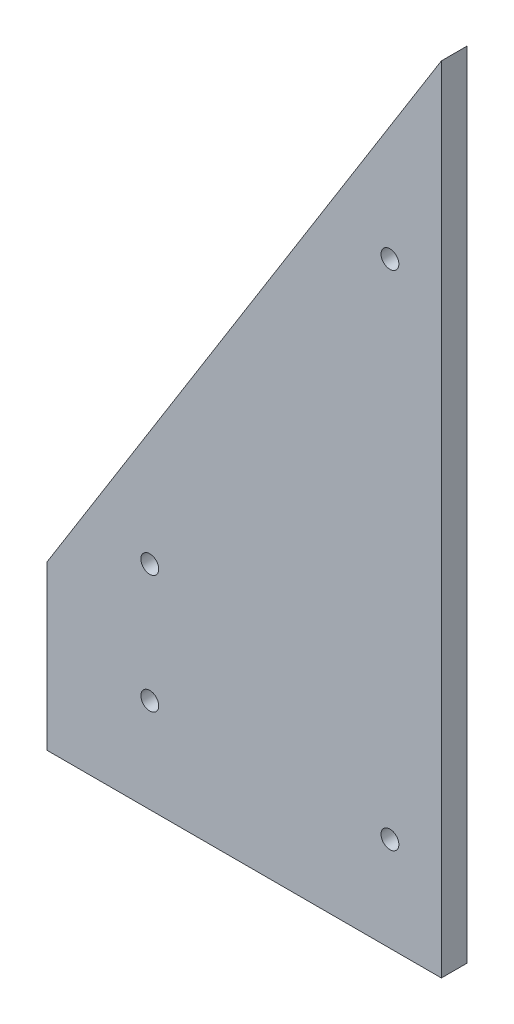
ISO-10303-21;
HEADER;
FILE_DESCRIPTION(('STEP AP214'),'2;1');
FILE_NAME('part.step','',(''),(''),'','','');
FILE_SCHEMA(('AUTOMOTIVE_DESIGN { 1 0 10303 214 1 1 1 1 }'));
ENDSEC;
DATA;
#1=APPLICATION_CONTEXT('core data for automotive mechanical design processes');
#2=APPLICATION_PROTOCOL_DEFINITION('international standard','automotive_design',2000,#1);
#3=PRODUCT_CONTEXT('',#1,'mechanical');
#4=PRODUCT('Part','Part','',(#3));
#5=PRODUCT_RELATED_PRODUCT_CATEGORY('part','',(#4));
#6=PRODUCT_DEFINITION_FORMATION('','',#4);
#7=PRODUCT_DEFINITION_CONTEXT('part definition',#1,'design');
#8=PRODUCT_DEFINITION('design','',#6,#7);
#9=PRODUCT_DEFINITION_SHAPE('','',#8);
#10=(LENGTH_UNIT() NAMED_UNIT(*) SI_UNIT(.MILLI.,.METRE.));
#11=(NAMED_UNIT(*) PLANE_ANGLE_UNIT() SI_UNIT($,.RADIAN.));
#12=(NAMED_UNIT(*) SI_UNIT($,.STERADIAN.) SOLID_ANGLE_UNIT());
#13=UNCERTAINTY_MEASURE_WITH_UNIT(LENGTH_MEASURE(1.E-05),#10,'distance_accuracy_value','');
#14=(GEOMETRIC_REPRESENTATION_CONTEXT(3) GLOBAL_UNCERTAINTY_ASSIGNED_CONTEXT((#13)) GLOBAL_UNIT_ASSIGNED_CONTEXT((#10,
#11,#12)) REPRESENTATION_CONTEXT('',''));
#15=CARTESIAN_POINT('',(0.,0.,0.));
#16=DIRECTION('',(0.,0.,1.));
#17=DIRECTION('',(1.,0.,0.));
#18=AXIS2_PLACEMENT_3D('',#15,#16,#17);
#19=CARTESIAN_POINT('',(146.05,0.,9.525));
#20=DIRECTION('',(0.,1.,0.));
#21=DIRECTION('',(-1.,0.,0.));
#22=AXIS2_PLACEMENT_3D('',#19,#20,#21);
#23=PLANE('',#22);
#24=DIRECTION('',(1.,0.,0.));
#25=VECTOR('',#24,1.);
#26=CARTESIAN_POINT('',(146.05,0.,0.));
#27=LINE('',#26,#25);
#28=CARTESIAN_POINT('',(0.,0.,0.));
#29=VERTEX_POINT('',#28);
#30=CARTESIAN_POINT('',(146.05,0.,0.));
#31=VERTEX_POINT('',#30);
#32=EDGE_CURVE('E93',#29,#31,#27,.T.);
#33=ORIENTED_EDGE('',*,*,#32,.T.);
#34=DIRECTION('',(0.,0.,-1.));
#35=VECTOR('',#34,1.);
#36=CARTESIAN_POINT('',(146.05,0.,9.525));
#37=LINE('',#36,#35);
#38=CARTESIAN_POINT('',(146.05,0.,9.525));
#39=VERTEX_POINT('',#38);
#40=EDGE_CURVE('E11',#39,#31,#37,.T.);
#41=ORIENTED_EDGE('',*,*,#40,.F.);
#42=DIRECTION('',(1.,0.,0.));
#43=VECTOR('',#42,1.);
#44=CARTESIAN_POINT('',(146.05,0.,9.525));
#45=LINE('',#44,#43);
#46=CARTESIAN_POINT('',(0.,0.,9.525));
#47=VERTEX_POINT('',#46);
#48=EDGE_CURVE('E81',#47,#39,#45,.T.);
#49=ORIENTED_EDGE('',*,*,#48,.F.);
#50=DIRECTION('',(0.,0.,-1.));
#51=VECTOR('',#50,1.);
#52=CARTESIAN_POINT('',(0.,0.,9.525));
#53=LINE('',#52,#51);
#54=EDGE_CURVE('E89',#47,#29,#53,.T.);
#55=ORIENTED_EDGE('',*,*,#54,.T.);
#56=EDGE_LOOP('',(#33,#41,#49,#55));
#57=FACE_BOUND('',#56,.T.);
#58=ADVANCED_FACE('F30',(#57),#23,.F.);
#59=CARTESIAN_POINT('',(146.05,0.,9.525));
#60=DIRECTION('',(-1.,0.,0.));
#61=DIRECTION('',(0.,0.,1.));
#62=AXIS2_PLACEMENT_3D('',#59,#60,#61);
#63=PLANE('',#62);
#64=DIRECTION('',(0.,1.,0.));
#65=VECTOR('',#64,1.);
#66=CARTESIAN_POINT('',(146.05,0.,0.));
#67=LINE('',#66,#65);
#68=CARTESIAN_POINT('',(146.05,294.053857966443,0.));
#69=VERTEX_POINT('',#68);
#70=EDGE_CURVE('E85',#31,#69,#67,.T.);
#71=ORIENTED_EDGE('',*,*,#70,.T.);
#72=DIRECTION('',(0.,0.,-1.));
#73=VECTOR('',#72,1.);
#74=CARTESIAN_POINT('',(146.05,294.053857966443,9.525));
#75=LINE('',#74,#73);
#76=CARTESIAN_POINT('',(146.05,294.053857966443,9.525));
#77=VERTEX_POINT('',#76);
#78=EDGE_CURVE('E38',#77,#69,#75,.T.);
#79=ORIENTED_EDGE('',*,*,#78,.F.);
#80=DIRECTION('',(0.,1.,0.));
#81=VECTOR('',#80,1.);
#82=CARTESIAN_POINT('',(146.05,0.,9.525));
#83=LINE('',#82,#81);
#84=EDGE_CURVE('E76',#39,#77,#83,.T.);
#85=ORIENTED_EDGE('',*,*,#84,.F.);
#86=ORIENTED_EDGE('',*,*,#40,.T.);
#87=EDGE_LOOP('',(#71,#79,#85,#86));
#88=FACE_BOUND('',#87,.T.);
#89=ADVANCED_FACE('F84',(#88),#63,.F.);
#90=CARTESIAN_POINT('',(0.,60.325,9.525));
#91=DIRECTION('',(0.848048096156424,-0.529919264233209,0.));
#92=DIRECTION('',(0.529919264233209,0.848048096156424,0.));
#93=AXIS2_PLACEMENT_3D('',#90,#91,#92);
#94=PLANE('',#93);
#95=DIRECTION('',(-0.529919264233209,-0.848048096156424,0.));
#96=VECTOR('',#95,1.);
#97=CARTESIAN_POINT('',(0.,60.325,0.));
#98=LINE('',#97,#96);
#99=CARTESIAN_POINT('',(0.,60.325,0.));
#100=VERTEX_POINT('',#99);
#101=EDGE_CURVE('E63',#69,#100,#98,.T.);
#102=ORIENTED_EDGE('',*,*,#101,.T.);
#103=DIRECTION('',(0.,0.,-1.));
#104=VECTOR('',#103,1.);
#105=CARTESIAN_POINT('',(0.,60.325,9.525));
#106=LINE('',#105,#104);
#107=CARTESIAN_POINT('',(0.,60.325,9.525));
#108=VERTEX_POINT('',#107);
#109=EDGE_CURVE('E86',#108,#100,#106,.T.);
#110=ORIENTED_EDGE('',*,*,#109,.F.);
#111=DIRECTION('',(-0.529919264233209,-0.848048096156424,0.));
#112=VECTOR('',#111,1.);
#113=CARTESIAN_POINT('',(0.,60.325,9.525));
#114=LINE('',#113,#112);
#115=EDGE_CURVE('E79',#77,#108,#114,.T.);
#116=ORIENTED_EDGE('',*,*,#115,.F.);
#117=ORIENTED_EDGE('',*,*,#78,.T.);
#118=EDGE_LOOP('',(#102,#110,#116,#117));
#119=FACE_BOUND('',#118,.T.);
#120=ADVANCED_FACE('F87',(#119),#94,.F.);
#121=CARTESIAN_POINT('',(0.,0.,9.525));
#122=DIRECTION('',(1.,0.,0.));
#123=DIRECTION('',(0.,0.,-1.));
#124=AXIS2_PLACEMENT_3D('',#121,#122,#123);
#125=PLANE('',#124);
#126=DIRECTION('',(0.,-1.,0.));
#127=VECTOR('',#126,1.);
#128=CARTESIAN_POINT('',(0.,0.,0.));
#129=LINE('',#128,#127);
#130=EDGE_CURVE('E69',#100,#29,#129,.T.);
#131=ORIENTED_EDGE('',*,*,#130,.T.);
#132=ORIENTED_EDGE('',*,*,#54,.F.);
#133=DIRECTION('',(0.,-1.,0.));
#134=VECTOR('',#133,1.);
#135=CARTESIAN_POINT('',(0.,0.,9.525));
#136=LINE('',#135,#134);
#137=EDGE_CURVE('E46',#108,#47,#136,.T.);
#138=ORIENTED_EDGE('',*,*,#137,.F.);
#139=ORIENTED_EDGE('',*,*,#109,.T.);
#140=EDGE_LOOP('',(#131,#132,#138,#139));
#141=FACE_BOUND('',#140,.T.);
#142=ADVANCED_FACE('F101',(#141),#125,.F.);
#143=CARTESIAN_POINT('',(0.,0.,9.525));
#144=DIRECTION('',(0.,0.,-1.));
#145=DIRECTION('',(-1.,0.,0.));
#146=AXIS2_PLACEMENT_3D('',#143,#144,#145);
#147=PLANE('',#146);
#148=CARTESIAN_POINT('',(38.1,34.925,9.525));
#149=DIRECTION('',(0.,0.,1.));
#150=DIRECTION('',(1.,0.,0.));
#151=AXIS2_PLACEMENT_3D('',#148,#149,#150);
#152=CIRCLE('',#151,3.302);
#153=CARTESIAN_POINT('',(41.402,34.925,9.525));
#154=VERTEX_POINT('',#153);
#155=EDGE_CURVE('E125',#154,#154,#152,.T.);
#156=ORIENTED_EDGE('',*,*,#155,.F.);
#157=EDGE_LOOP('',(#156));
#158=FACE_BOUND('',#157,.T.);
#159=CARTESIAN_POINT('',(127.,220.98,9.525));
#160=DIRECTION('',(0.,0.,1.));
#161=DIRECTION('',(1.,0.,0.));
#162=AXIS2_PLACEMENT_3D('',#159,#160,#161);
#163=CIRCLE('',#162,3.30200000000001);
#164=CARTESIAN_POINT('',(130.302,220.98,9.525));
#165=VERTEX_POINT('',#164);
#166=EDGE_CURVE('E119',#165,#165,#163,.T.);
#167=ORIENTED_EDGE('',*,*,#166,.F.);
#168=EDGE_LOOP('',(#167));
#169=FACE_BOUND('',#168,.T.);
#170=CARTESIAN_POINT('',(127.,34.925,9.525));
#171=DIRECTION('',(0.,0.,1.));
#172=DIRECTION('',(1.,0.,0.));
#173=AXIS2_PLACEMENT_3D('',#170,#171,#172);
#174=CIRCLE('',#173,3.30200000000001);
#175=CARTESIAN_POINT('',(130.302,34.925,9.525));
#176=VERTEX_POINT('',#175);
#177=EDGE_CURVE('E113',#176,#176,#174,.T.);
#178=ORIENTED_EDGE('',*,*,#177,.F.);
#179=EDGE_LOOP('',(#178));
#180=FACE_BOUND('',#179,.T.);
#181=CARTESIAN_POINT('',(38.1,78.74,9.525));
#182=DIRECTION('',(0.,0.,1.));
#183=DIRECTION('',(1.,0.,0.));
#184=AXIS2_PLACEMENT_3D('',#181,#182,#183);
#185=CIRCLE('',#184,3.30199999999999);
#186=CARTESIAN_POINT('',(41.402,78.74,9.525));
#187=VERTEX_POINT('',#186);
#188=EDGE_CURVE('E107',#187,#187,#185,.T.);
#189=ORIENTED_EDGE('',*,*,#188,.F.);
#190=EDGE_LOOP('',(#189));
#191=FACE_BOUND('',#190,.T.);
#192=ORIENTED_EDGE('',*,*,#48,.T.);
#193=ORIENTED_EDGE('',*,*,#84,.T.);
#194=ORIENTED_EDGE('',*,*,#115,.T.);
#195=ORIENTED_EDGE('',*,*,#137,.T.);
#196=EDGE_LOOP('',(#192,#193,#194,#195));
#197=FACE_BOUND('',#196,.T.);
#198=ADVANCED_FACE('F77',(#158,#169,#180,#191,#197),#147,.F.);
#199=CARTESIAN_POINT('',(0.,0.,0.));
#200=DIRECTION('',(0.,0.,-1.));
#201=DIRECTION('',(-1.,0.,0.));
#202=AXIS2_PLACEMENT_3D('',#199,#200,#201);
#203=PLANE('',#202);
#204=CARTESIAN_POINT('',(38.1,34.925,0.));
#205=DIRECTION('',(0.,0.,1.));
#206=DIRECTION('',(1.,0.,0.));
#207=AXIS2_PLACEMENT_3D('',#204,#205,#206);
#208=CIRCLE('',#207,3.302);
#209=CARTESIAN_POINT('',(41.402,34.925,0.));
#210=VERTEX_POINT('',#209);
#211=EDGE_CURVE('E122',#210,#210,#208,.T.);
#212=ORIENTED_EDGE('',*,*,#211,.T.);
#213=EDGE_LOOP('',(#212));
#214=FACE_BOUND('',#213,.T.);
#215=CARTESIAN_POINT('',(127.,220.98,0.));
#216=DIRECTION('',(0.,0.,1.));
#217=DIRECTION('',(1.,0.,0.));
#218=AXIS2_PLACEMENT_3D('',#215,#216,#217);
#219=CIRCLE('',#218,3.30200000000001);
#220=CARTESIAN_POINT('',(130.302,220.98,0.));
#221=VERTEX_POINT('',#220);
#222=EDGE_CURVE('E116',#221,#221,#219,.T.);
#223=ORIENTED_EDGE('',*,*,#222,.T.);
#224=EDGE_LOOP('',(#223));
#225=FACE_BOUND('',#224,.T.);
#226=CARTESIAN_POINT('',(127.,34.925,0.));
#227=DIRECTION('',(0.,0.,1.));
#228=DIRECTION('',(1.,0.,0.));
#229=AXIS2_PLACEMENT_3D('',#226,#227,#228);
#230=CIRCLE('',#229,3.30200000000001);
#231=CARTESIAN_POINT('',(130.302,34.925,0.));
#232=VERTEX_POINT('',#231);
#233=EDGE_CURVE('E110',#232,#232,#230,.T.);
#234=ORIENTED_EDGE('',*,*,#233,.T.);
#235=EDGE_LOOP('',(#234));
#236=FACE_BOUND('',#235,.T.);
#237=CARTESIAN_POINT('',(38.1,78.74,0.));
#238=DIRECTION('',(0.,0.,1.));
#239=DIRECTION('',(1.,0.,0.));
#240=AXIS2_PLACEMENT_3D('',#237,#238,#239);
#241=CIRCLE('',#240,3.30199999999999);
#242=CARTESIAN_POINT('',(41.402,78.74,0.));
#243=VERTEX_POINT('',#242);
#244=EDGE_CURVE('E96',#243,#243,#241,.T.);
#245=ORIENTED_EDGE('',*,*,#244,.T.);
#246=EDGE_LOOP('',(#245));
#247=FACE_BOUND('',#246,.T.);
#248=ORIENTED_EDGE('',*,*,#32,.F.);
#249=ORIENTED_EDGE('',*,*,#130,.F.);
#250=ORIENTED_EDGE('',*,*,#101,.F.);
#251=ORIENTED_EDGE('',*,*,#70,.F.);
#252=EDGE_LOOP('',(#248,#249,#250,#251));
#253=FACE_BOUND('',#252,.T.);
#254=ADVANCED_FACE('F104',(#214,#225,#236,#247,#253),#203,.T.);
#255=CARTESIAN_POINT('',(38.1,78.74,0.));
#256=DIRECTION('',(0.,0.,1.));
#257=DIRECTION('',(1.,0.,0.));
#258=AXIS2_PLACEMENT_3D('',#255,#256,#257);
#259=CYLINDRICAL_SURFACE('',#258,3.30199999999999);
#260=CARTESIAN_POINT('',(41.402,78.74,0.));
#261=CARTESIAN_POINT('',(41.402,78.74,0.0992187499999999));
#262=CARTESIAN_POINT('',(41.402,78.74,0.1984375));
#263=CARTESIAN_POINT('',(41.402,78.74,0.396875));
#264=CARTESIAN_POINT('',(41.402,78.74,0.49609375));
#265=CARTESIAN_POINT('',(41.402,78.74,0.69453125));
#266=CARTESIAN_POINT('',(41.402,78.74,0.79375));
#267=CARTESIAN_POINT('',(41.402,78.74,0.9921875));
#268=CARTESIAN_POINT('',(41.402,78.74,1.09140625));
#269=CARTESIAN_POINT('',(41.402,78.74,1.28984375));
#270=CARTESIAN_POINT('',(41.402,78.74,1.3890625));
#271=CARTESIAN_POINT('',(41.402,78.74,1.5875));
#272=CARTESIAN_POINT('',(41.402,78.74,1.68671875));
#273=CARTESIAN_POINT('',(41.402,78.74,1.88515625));
#274=CARTESIAN_POINT('',(41.402,78.74,1.984375));
#275=CARTESIAN_POINT('',(41.402,78.74,2.1828125));
#276=CARTESIAN_POINT('',(41.402,78.74,2.28203125));
#277=CARTESIAN_POINT('',(41.402,78.74,2.48046875));
#278=CARTESIAN_POINT('',(41.402,78.74,2.5796875));
#279=CARTESIAN_POINT('',(41.402,78.74,2.778125));
#280=CARTESIAN_POINT('',(41.402,78.74,2.87734375));
#281=CARTESIAN_POINT('',(41.402,78.74,3.07578125));
#282=CARTESIAN_POINT('',(41.402,78.74,3.175));
#283=CARTESIAN_POINT('',(41.402,78.74,3.3734375));
#284=CARTESIAN_POINT('',(41.402,78.74,3.47265625));
#285=CARTESIAN_POINT('',(41.402,78.74,3.67109375));
#286=CARTESIAN_POINT('',(41.402,78.74,3.7703125));
#287=CARTESIAN_POINT('',(41.402,78.74,3.96875));
#288=CARTESIAN_POINT('',(41.402,78.74,4.06796875));
#289=CARTESIAN_POINT('',(41.402,78.74,4.26640625));
#290=CARTESIAN_POINT('',(41.402,78.74,4.365625));
#291=CARTESIAN_POINT('',(41.402,78.74,4.5640625));
#292=CARTESIAN_POINT('',(41.402,78.74,4.66328125));
#293=CARTESIAN_POINT('',(41.402,78.74,4.86171875));
#294=CARTESIAN_POINT('',(41.402,78.74,4.9609375));
#295=CARTESIAN_POINT('',(41.402,78.74,5.159375));
#296=CARTESIAN_POINT('',(41.402,78.74,5.25859375));
#297=CARTESIAN_POINT('',(41.402,78.74,5.45703125));
#298=CARTESIAN_POINT('',(41.402,78.74,5.55625));
#299=CARTESIAN_POINT('',(41.402,78.74,5.7546875));
#300=CARTESIAN_POINT('',(41.402,78.74,5.85390625));
#301=CARTESIAN_POINT('',(41.402,78.74,6.05234375));
#302=CARTESIAN_POINT('',(41.402,78.74,6.1515625));
#303=CARTESIAN_POINT('',(41.402,78.74,6.35));
#304=CARTESIAN_POINT('',(41.402,78.74,6.44921875));
#305=CARTESIAN_POINT('',(41.402,78.74,6.64765625));
#306=CARTESIAN_POINT('',(41.402,78.74,6.746875));
#307=CARTESIAN_POINT('',(41.402,78.74,6.9453125));
#308=CARTESIAN_POINT('',(41.402,78.74,7.04453125));
#309=CARTESIAN_POINT('',(41.402,78.74,7.24296875));
#310=CARTESIAN_POINT('',(41.402,78.74,7.3421875));
#311=CARTESIAN_POINT('',(41.402,78.74,7.540625));
#312=CARTESIAN_POINT('',(41.402,78.74,7.63984375));
#313=CARTESIAN_POINT('',(41.402,78.74,7.83828125));
#314=CARTESIAN_POINT('',(41.402,78.74,7.9375));
#315=CARTESIAN_POINT('',(41.402,78.74,8.1359375));
#316=CARTESIAN_POINT('',(41.402,78.74,8.23515625));
#317=CARTESIAN_POINT('',(41.402,78.74,8.43359375));
#318=CARTESIAN_POINT('',(41.402,78.74,8.5328125));
#319=CARTESIAN_POINT('',(41.402,78.74,8.73125));
#320=CARTESIAN_POINT('',(41.402,78.74,8.83046875));
#321=CARTESIAN_POINT('',(41.402,78.74,9.02890625));
#322=CARTESIAN_POINT('',(41.402,78.74,9.128125));
#323=CARTESIAN_POINT('',(41.402,78.74,9.3265625));
#324=CARTESIAN_POINT('',(41.402,78.74,9.42578125));
#325=CARTESIAN_POINT('',(41.402,78.74,9.525));
#326=B_SPLINE_CURVE_WITH_KNOTS('',3,(#260,#261,#262,#263,#264,#265,#266,#267,#268,#269,#270,
#271,#272,#273,#274,#275,#276,#277,#278,#279,#280,#281,#282,#283,#284,#285,#286,#287,#288,#289,
#290,#291,#292,#293,#294,#295,#296,#297,#298,#299,#300,#301,#302,#303,#304,#305,#306,#307,#308,
#309,#310,#311,#312,#313,#314,#315,#316,#317,#318,#319,#320,#321,#322,#323,#324,#325),
.UNSPECIFIED.,.F.,.F.,(4,2,2,2,2,2,2,2,2,2,2,2,2,2,2,2,2,2,2,2,2,2,2,2,2,2,2,2,2,2,2,2,4),(0.,
0.29765625,0.5953125,0.89296875,1.190625,1.48828125,1.7859375,2.08359375,2.38125,2.67890625,
2.9765625,3.27421875,3.571875,3.86953125,4.1671875,4.46484375,4.7625,5.06015625,5.3578125,
5.65546875,5.953125,6.25078125,6.5484375,6.84609375,7.14375,7.44140625,7.7390625,8.03671875,
8.334375,8.63203125,8.9296875,9.22734375,9.525),.UNSPECIFIED.);
#327=EDGE_CURVE('BSEAM149',#243,#187,#326,.T.);
#328=ORIENTED_EDGE('',*,*,#244,.F.);
#329=ORIENTED_EDGE('',*,*,#188,.T.);
#330=ORIENTED_EDGE('',*,*,#327,.T.);
#331=ORIENTED_EDGE('',*,*,#327,.F.);
#332=EDGE_LOOP('',(#328,#330,#329,#331));
#333=FACE_BOUND('',#332,.T.);
#334=ADVANCED_FACE('F149',(#333),#259,.F.);
#335=CARTESIAN_POINT('',(127.,34.925,0.));
#336=DIRECTION('',(0.,0.,1.));
#337=DIRECTION('',(1.,0.,0.));
#338=AXIS2_PLACEMENT_3D('',#335,#336,#337);
#339=CYLINDRICAL_SURFACE('',#338,3.30200000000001);
#340=CARTESIAN_POINT('',(130.302,34.925,0.));
#341=CARTESIAN_POINT('',(130.302,34.925,0.0992187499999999));
#342=CARTESIAN_POINT('',(130.302,34.925,0.1984375));
#343=CARTESIAN_POINT('',(130.302,34.925,0.396875));
#344=CARTESIAN_POINT('',(130.302,34.925,0.49609375));
#345=CARTESIAN_POINT('',(130.302,34.925,0.69453125));
#346=CARTESIAN_POINT('',(130.302,34.925,0.79375));
#347=CARTESIAN_POINT('',(130.302,34.925,0.9921875));
#348=CARTESIAN_POINT('',(130.302,34.925,1.09140625));
#349=CARTESIAN_POINT('',(130.302,34.925,1.28984375));
#350=CARTESIAN_POINT('',(130.302,34.925,1.3890625));
#351=CARTESIAN_POINT('',(130.302,34.925,1.5875));
#352=CARTESIAN_POINT('',(130.302,34.925,1.68671875));
#353=CARTESIAN_POINT('',(130.302,34.925,1.88515625));
#354=CARTESIAN_POINT('',(130.302,34.925,1.984375));
#355=CARTESIAN_POINT('',(130.302,34.925,2.1828125));
#356=CARTESIAN_POINT('',(130.302,34.925,2.28203125));
#357=CARTESIAN_POINT('',(130.302,34.925,2.48046875));
#358=CARTESIAN_POINT('',(130.302,34.925,2.5796875));
#359=CARTESIAN_POINT('',(130.302,34.925,2.778125));
#360=CARTESIAN_POINT('',(130.302,34.925,2.87734375));
#361=CARTESIAN_POINT('',(130.302,34.925,3.07578125));
#362=CARTESIAN_POINT('',(130.302,34.925,3.175));
#363=CARTESIAN_POINT('',(130.302,34.925,3.3734375));
#364=CARTESIAN_POINT('',(130.302,34.925,3.47265625));
#365=CARTESIAN_POINT('',(130.302,34.925,3.67109375));
#366=CARTESIAN_POINT('',(130.302,34.925,3.7703125));
#367=CARTESIAN_POINT('',(130.302,34.925,3.96875));
#368=CARTESIAN_POINT('',(130.302,34.925,4.06796875));
#369=CARTESIAN_POINT('',(130.302,34.925,4.26640625));
#370=CARTESIAN_POINT('',(130.302,34.925,4.365625));
#371=CARTESIAN_POINT('',(130.302,34.925,4.5640625));
#372=CARTESIAN_POINT('',(130.302,34.925,4.66328125));
#373=CARTESIAN_POINT('',(130.302,34.925,4.86171875));
#374=CARTESIAN_POINT('',(130.302,34.925,4.9609375));
#375=CARTESIAN_POINT('',(130.302,34.925,5.159375));
#376=CARTESIAN_POINT('',(130.302,34.925,5.25859375));
#377=CARTESIAN_POINT('',(130.302,34.925,5.45703125));
#378=CARTESIAN_POINT('',(130.302,34.925,5.55625));
#379=CARTESIAN_POINT('',(130.302,34.925,5.7546875));
#380=CARTESIAN_POINT('',(130.302,34.925,5.85390625));
#381=CARTESIAN_POINT('',(130.302,34.925,6.05234375));
#382=CARTESIAN_POINT('',(130.302,34.925,6.1515625));
#383=CARTESIAN_POINT('',(130.302,34.925,6.35));
#384=CARTESIAN_POINT('',(130.302,34.925,6.44921875));
#385=CARTESIAN_POINT('',(130.302,34.925,6.64765625));
#386=CARTESIAN_POINT('',(130.302,34.925,6.746875));
#387=CARTESIAN_POINT('',(130.302,34.925,6.9453125));
#388=CARTESIAN_POINT('',(130.302,34.925,7.04453125));
#389=CARTESIAN_POINT('',(130.302,34.925,7.24296875));
#390=CARTESIAN_POINT('',(130.302,34.925,7.3421875));
#391=CARTESIAN_POINT('',(130.302,34.925,7.540625));
#392=CARTESIAN_POINT('',(130.302,34.925,7.63984375));
#393=CARTESIAN_POINT('',(130.302,34.925,7.83828125));
#394=CARTESIAN_POINT('',(130.302,34.925,7.9375));
#395=CARTESIAN_POINT('',(130.302,34.925,8.1359375));
#396=CARTESIAN_POINT('',(130.302,34.925,8.23515625));
#397=CARTESIAN_POINT('',(130.302,34.925,8.43359375));
#398=CARTESIAN_POINT('',(130.302,34.925,8.5328125));
#399=CARTESIAN_POINT('',(130.302,34.925,8.73125));
#400=CARTESIAN_POINT('',(130.302,34.925,8.83046875));
#401=CARTESIAN_POINT('',(130.302,34.925,9.02890625));
#402=CARTESIAN_POINT('',(130.302,34.925,9.128125));
#403=CARTESIAN_POINT('',(130.302,34.925,9.3265625));
#404=CARTESIAN_POINT('',(130.302,34.925,9.42578125));
#405=CARTESIAN_POINT('',(130.302,34.925,9.525));
#406=B_SPLINE_CURVE_WITH_KNOTS('',3,(#340,#341,#342,#343,#344,#345,#346,#347,#348,#349,#350,
#351,#352,#353,#354,#355,#356,#357,#358,#359,#360,#361,#362,#363,#364,#365,#366,#367,#368,#369,
#370,#371,#372,#373,#374,#375,#376,#377,#378,#379,#380,#381,#382,#383,#384,#385,#386,#387,#388,
#389,#390,#391,#392,#393,#394,#395,#396,#397,#398,#399,#400,#401,#402,#403,#404,#405),
.UNSPECIFIED.,.F.,.F.,(4,2,2,2,2,2,2,2,2,2,2,2,2,2,2,2,2,2,2,2,2,2,2,2,2,2,2,2,2,2,2,2,4),(0.,
0.29765625,0.5953125,0.89296875,1.190625,1.48828125,1.7859375,2.08359375,2.38125,2.67890625,
2.9765625,3.27421875,3.571875,3.86953125,4.1671875,4.46484375,4.7625,5.06015625,5.3578125,
5.65546875,5.953125,6.25078125,6.5484375,6.84609375,7.14375,7.44140625,7.7390625,8.03671875,
8.334375,8.63203125,8.9296875,9.22734375,9.525),.UNSPECIFIED.);
#407=EDGE_CURVE('BSEAM151',#232,#176,#406,.T.);
#408=ORIENTED_EDGE('',*,*,#233,.F.);
#409=ORIENTED_EDGE('',*,*,#177,.T.);
#410=ORIENTED_EDGE('',*,*,#407,.T.);
#411=ORIENTED_EDGE('',*,*,#407,.F.);
#412=EDGE_LOOP('',(#408,#410,#409,#411));
#413=FACE_BOUND('',#412,.T.);
#414=ADVANCED_FACE('F151',(#413),#339,.F.);
#415=CARTESIAN_POINT('',(127.,220.98,0.));
#416=DIRECTION('',(0.,0.,1.));
#417=DIRECTION('',(1.,0.,0.));
#418=AXIS2_PLACEMENT_3D('',#415,#416,#417);
#419=CYLINDRICAL_SURFACE('',#418,3.30200000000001);
#420=CARTESIAN_POINT('',(130.302,220.98,0.));
#421=CARTESIAN_POINT('',(130.302,220.98,0.0992187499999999));
#422=CARTESIAN_POINT('',(130.302,220.98,0.1984375));
#423=CARTESIAN_POINT('',(130.302,220.98,0.396875));
#424=CARTESIAN_POINT('',(130.302,220.98,0.49609375));
#425=CARTESIAN_POINT('',(130.302,220.98,0.69453125));
#426=CARTESIAN_POINT('',(130.302,220.98,0.79375));
#427=CARTESIAN_POINT('',(130.302,220.98,0.9921875));
#428=CARTESIAN_POINT('',(130.302,220.98,1.09140625));
#429=CARTESIAN_POINT('',(130.302,220.98,1.28984375));
#430=CARTESIAN_POINT('',(130.302,220.98,1.3890625));
#431=CARTESIAN_POINT('',(130.302,220.98,1.5875));
#432=CARTESIAN_POINT('',(130.302,220.98,1.68671875));
#433=CARTESIAN_POINT('',(130.302,220.98,1.88515625));
#434=CARTESIAN_POINT('',(130.302,220.98,1.984375));
#435=CARTESIAN_POINT('',(130.302,220.98,2.1828125));
#436=CARTESIAN_POINT('',(130.302,220.98,2.28203125));
#437=CARTESIAN_POINT('',(130.302,220.98,2.48046875));
#438=CARTESIAN_POINT('',(130.302,220.98,2.5796875));
#439=CARTESIAN_POINT('',(130.302,220.98,2.778125));
#440=CARTESIAN_POINT('',(130.302,220.98,2.87734375));
#441=CARTESIAN_POINT('',(130.302,220.98,3.07578125));
#442=CARTESIAN_POINT('',(130.302,220.98,3.175));
#443=CARTESIAN_POINT('',(130.302,220.98,3.3734375));
#444=CARTESIAN_POINT('',(130.302,220.98,3.47265625));
#445=CARTESIAN_POINT('',(130.302,220.98,3.67109375));
#446=CARTESIAN_POINT('',(130.302,220.98,3.7703125));
#447=CARTESIAN_POINT('',(130.302,220.98,3.96875));
#448=CARTESIAN_POINT('',(130.302,220.98,4.06796875));
#449=CARTESIAN_POINT('',(130.302,220.98,4.26640625));
#450=CARTESIAN_POINT('',(130.302,220.98,4.365625));
#451=CARTESIAN_POINT('',(130.302,220.98,4.5640625));
#452=CARTESIAN_POINT('',(130.302,220.98,4.66328125));
#453=CARTESIAN_POINT('',(130.302,220.98,4.86171875));
#454=CARTESIAN_POINT('',(130.302,220.98,4.9609375));
#455=CARTESIAN_POINT('',(130.302,220.98,5.159375));
#456=CARTESIAN_POINT('',(130.302,220.98,5.25859375));
#457=CARTESIAN_POINT('',(130.302,220.98,5.45703125));
#458=CARTESIAN_POINT('',(130.302,220.98,5.55625));
#459=CARTESIAN_POINT('',(130.302,220.98,5.7546875));
#460=CARTESIAN_POINT('',(130.302,220.98,5.85390625));
#461=CARTESIAN_POINT('',(130.302,220.98,6.05234375));
#462=CARTESIAN_POINT('',(130.302,220.98,6.1515625));
#463=CARTESIAN_POINT('',(130.302,220.98,6.35));
#464=CARTESIAN_POINT('',(130.302,220.98,6.44921875));
#465=CARTESIAN_POINT('',(130.302,220.98,6.64765625));
#466=CARTESIAN_POINT('',(130.302,220.98,6.746875));
#467=CARTESIAN_POINT('',(130.302,220.98,6.9453125));
#468=CARTESIAN_POINT('',(130.302,220.98,7.04453125));
#469=CARTESIAN_POINT('',(130.302,220.98,7.24296875));
#470=CARTESIAN_POINT('',(130.302,220.98,7.3421875));
#471=CARTESIAN_POINT('',(130.302,220.98,7.540625));
#472=CARTESIAN_POINT('',(130.302,220.98,7.63984375));
#473=CARTESIAN_POINT('',(130.302,220.98,7.83828125));
#474=CARTESIAN_POINT('',(130.302,220.98,7.9375));
#475=CARTESIAN_POINT('',(130.302,220.98,8.1359375));
#476=CARTESIAN_POINT('',(130.302,220.98,8.23515625));
#477=CARTESIAN_POINT('',(130.302,220.98,8.43359375));
#478=CARTESIAN_POINT('',(130.302,220.98,8.5328125));
#479=CARTESIAN_POINT('',(130.302,220.98,8.73125));
#480=CARTESIAN_POINT('',(130.302,220.98,8.83046875));
#481=CARTESIAN_POINT('',(130.302,220.98,9.02890625));
#482=CARTESIAN_POINT('',(130.302,220.98,9.128125));
#483=CARTESIAN_POINT('',(130.302,220.98,9.3265625));
#484=CARTESIAN_POINT('',(130.302,220.98,9.42578125));
#485=CARTESIAN_POINT('',(130.302,220.98,9.525));
#486=B_SPLINE_CURVE_WITH_KNOTS('',3,(#420,#421,#422,#423,#424,#425,#426,#427,#428,#429,#430,
#431,#432,#433,#434,#435,#436,#437,#438,#439,#440,#441,#442,#443,#444,#445,#446,#447,#448,#449,
#450,#451,#452,#453,#454,#455,#456,#457,#458,#459,#460,#461,#462,#463,#464,#465,#466,#467,#468,
#469,#470,#471,#472,#473,#474,#475,#476,#477,#478,#479,#480,#481,#482,#483,#484,#485),
.UNSPECIFIED.,.F.,.F.,(4,2,2,2,2,2,2,2,2,2,2,2,2,2,2,2,2,2,2,2,2,2,2,2,2,2,2,2,2,2,2,2,4),(0.,
0.29765625,0.5953125,0.89296875,1.190625,1.48828125,1.7859375,2.08359375,2.38125,2.67890625,
2.9765625,3.27421875,3.571875,3.86953125,4.1671875,4.46484375,4.7625,5.06015625,5.3578125,
5.65546875,5.953125,6.25078125,6.5484375,6.84609375,7.14375,7.44140625,7.7390625,8.03671875,
8.334375,8.63203125,8.9296875,9.22734375,9.525),.UNSPECIFIED.);
#487=EDGE_CURVE('BSEAM136',#221,#165,#486,.T.);
#488=ORIENTED_EDGE('',*,*,#222,.F.);
#489=ORIENTED_EDGE('',*,*,#166,.T.);
#490=ORIENTED_EDGE('',*,*,#487,.T.);
#491=ORIENTED_EDGE('',*,*,#487,.F.);
#492=EDGE_LOOP('',(#488,#490,#489,#491));
#493=FACE_BOUND('',#492,.T.);
#494=ADVANCED_FACE('F136',(#493),#419,.F.);
#495=CARTESIAN_POINT('',(38.1,34.925,0.));
#496=DIRECTION('',(0.,0.,1.));
#497=DIRECTION('',(1.,0.,0.));
#498=AXIS2_PLACEMENT_3D('',#495,#496,#497);
#499=CYLINDRICAL_SURFACE('',#498,3.302);
#500=CARTESIAN_POINT('',(41.402,34.925,0.));
#501=CARTESIAN_POINT('',(41.402,34.925,0.0992187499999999));
#502=CARTESIAN_POINT('',(41.402,34.925,0.1984375));
#503=CARTESIAN_POINT('',(41.402,34.925,0.396875));
#504=CARTESIAN_POINT('',(41.402,34.925,0.49609375));
#505=CARTESIAN_POINT('',(41.402,34.925,0.69453125));
#506=CARTESIAN_POINT('',(41.402,34.925,0.79375));
#507=CARTESIAN_POINT('',(41.402,34.925,0.9921875));
#508=CARTESIAN_POINT('',(41.402,34.925,1.09140625));
#509=CARTESIAN_POINT('',(41.402,34.925,1.28984375));
#510=CARTESIAN_POINT('',(41.402,34.925,1.3890625));
#511=CARTESIAN_POINT('',(41.402,34.925,1.5875));
#512=CARTESIAN_POINT('',(41.402,34.925,1.68671875));
#513=CARTESIAN_POINT('',(41.402,34.925,1.88515625));
#514=CARTESIAN_POINT('',(41.402,34.925,1.984375));
#515=CARTESIAN_POINT('',(41.402,34.925,2.1828125));
#516=CARTESIAN_POINT('',(41.402,34.925,2.28203125));
#517=CARTESIAN_POINT('',(41.402,34.925,2.48046875));
#518=CARTESIAN_POINT('',(41.402,34.925,2.5796875));
#519=CARTESIAN_POINT('',(41.402,34.925,2.778125));
#520=CARTESIAN_POINT('',(41.402,34.925,2.87734375));
#521=CARTESIAN_POINT('',(41.402,34.925,3.07578125));
#522=CARTESIAN_POINT('',(41.402,34.925,3.175));
#523=CARTESIAN_POINT('',(41.402,34.925,3.3734375));
#524=CARTESIAN_POINT('',(41.402,34.925,3.47265625));
#525=CARTESIAN_POINT('',(41.402,34.925,3.67109375));
#526=CARTESIAN_POINT('',(41.402,34.925,3.7703125));
#527=CARTESIAN_POINT('',(41.402,34.925,3.96875));
#528=CARTESIAN_POINT('',(41.402,34.925,4.06796875));
#529=CARTESIAN_POINT('',(41.402,34.925,4.26640625));
#530=CARTESIAN_POINT('',(41.402,34.925,4.365625));
#531=CARTESIAN_POINT('',(41.402,34.925,4.5640625));
#532=CARTESIAN_POINT('',(41.402,34.925,4.66328125));
#533=CARTESIAN_POINT('',(41.402,34.925,4.86171875));
#534=CARTESIAN_POINT('',(41.402,34.925,4.9609375));
#535=CARTESIAN_POINT('',(41.402,34.925,5.159375));
#536=CARTESIAN_POINT('',(41.402,34.925,5.25859375));
#537=CARTESIAN_POINT('',(41.402,34.925,5.45703125));
#538=CARTESIAN_POINT('',(41.402,34.925,5.55625));
#539=CARTESIAN_POINT('',(41.402,34.925,5.7546875));
#540=CARTESIAN_POINT('',(41.402,34.925,5.85390625));
#541=CARTESIAN_POINT('',(41.402,34.925,6.05234375));
#542=CARTESIAN_POINT('',(41.402,34.925,6.1515625));
#543=CARTESIAN_POINT('',(41.402,34.925,6.35));
#544=CARTESIAN_POINT('',(41.402,34.925,6.44921875));
#545=CARTESIAN_POINT('',(41.402,34.925,6.64765625));
#546=CARTESIAN_POINT('',(41.402,34.925,6.746875));
#547=CARTESIAN_POINT('',(41.402,34.925,6.9453125));
#548=CARTESIAN_POINT('',(41.402,34.925,7.04453125));
#549=CARTESIAN_POINT('',(41.402,34.925,7.24296875));
#550=CARTESIAN_POINT('',(41.402,34.925,7.3421875));
#551=CARTESIAN_POINT('',(41.402,34.925,7.540625));
#552=CARTESIAN_POINT('',(41.402,34.925,7.63984375));
#553=CARTESIAN_POINT('',(41.402,34.925,7.83828125));
#554=CARTESIAN_POINT('',(41.402,34.925,7.9375));
#555=CARTESIAN_POINT('',(41.402,34.925,8.1359375));
#556=CARTESIAN_POINT('',(41.402,34.925,8.23515625));
#557=CARTESIAN_POINT('',(41.402,34.925,8.43359375));
#558=CARTESIAN_POINT('',(41.402,34.925,8.5328125));
#559=CARTESIAN_POINT('',(41.402,34.925,8.73125));
#560=CARTESIAN_POINT('',(41.402,34.925,8.83046875));
#561=CARTESIAN_POINT('',(41.402,34.925,9.02890625));
#562=CARTESIAN_POINT('',(41.402,34.925,9.128125));
#563=CARTESIAN_POINT('',(41.402,34.925,9.3265625));
#564=CARTESIAN_POINT('',(41.402,34.925,9.42578125));
#565=CARTESIAN_POINT('',(41.402,34.925,9.525));
#566=B_SPLINE_CURVE_WITH_KNOTS('',3,(#500,#501,#502,#503,#504,#505,#506,#507,#508,#509,#510,
#511,#512,#513,#514,#515,#516,#517,#518,#519,#520,#521,#522,#523,#524,#525,#526,#527,#528,#529,
#530,#531,#532,#533,#534,#535,#536,#537,#538,#539,#540,#541,#542,#543,#544,#545,#546,#547,#548,
#549,#550,#551,#552,#553,#554,#555,#556,#557,#558,#559,#560,#561,#562,#563,#564,#565),
.UNSPECIFIED.,.F.,.F.,(4,2,2,2,2,2,2,2,2,2,2,2,2,2,2,2,2,2,2,2,2,2,2,2,2,2,2,2,2,2,2,2,4),(0.,
0.29765625,0.5953125,0.89296875,1.190625,1.48828125,1.7859375,2.08359375,2.38125,2.67890625,
2.9765625,3.27421875,3.571875,3.86953125,4.1671875,4.46484375,4.7625,5.06015625,5.3578125,
5.65546875,5.953125,6.25078125,6.5484375,6.84609375,7.14375,7.44140625,7.7390625,8.03671875,
8.334375,8.63203125,8.9296875,9.22734375,9.525),.UNSPECIFIED.);
#567=EDGE_CURVE('BSEAM133',#210,#154,#566,.T.);
#568=ORIENTED_EDGE('',*,*,#211,.F.);
#569=ORIENTED_EDGE('',*,*,#155,.T.);
#570=ORIENTED_EDGE('',*,*,#567,.T.);
#571=ORIENTED_EDGE('',*,*,#567,.F.);
#572=EDGE_LOOP('',(#568,#570,#569,#571));
#573=FACE_BOUND('',#572,.T.);
#574=ADVANCED_FACE('F133',(#573),#499,.F.);
#575=CLOSED_SHELL('',(#58,#89,#120,#142,#198,#254,#334,#414,#494,#574));
#576=MANIFOLD_SOLID_BREP('B2',#575);
#577=ADVANCED_BREP_SHAPE_REPRESENTATION('',(#18,#576),#14);
#578=SHAPE_DEFINITION_REPRESENTATION(#9,#577);
ENDSEC;
END-ISO-10303-21;
